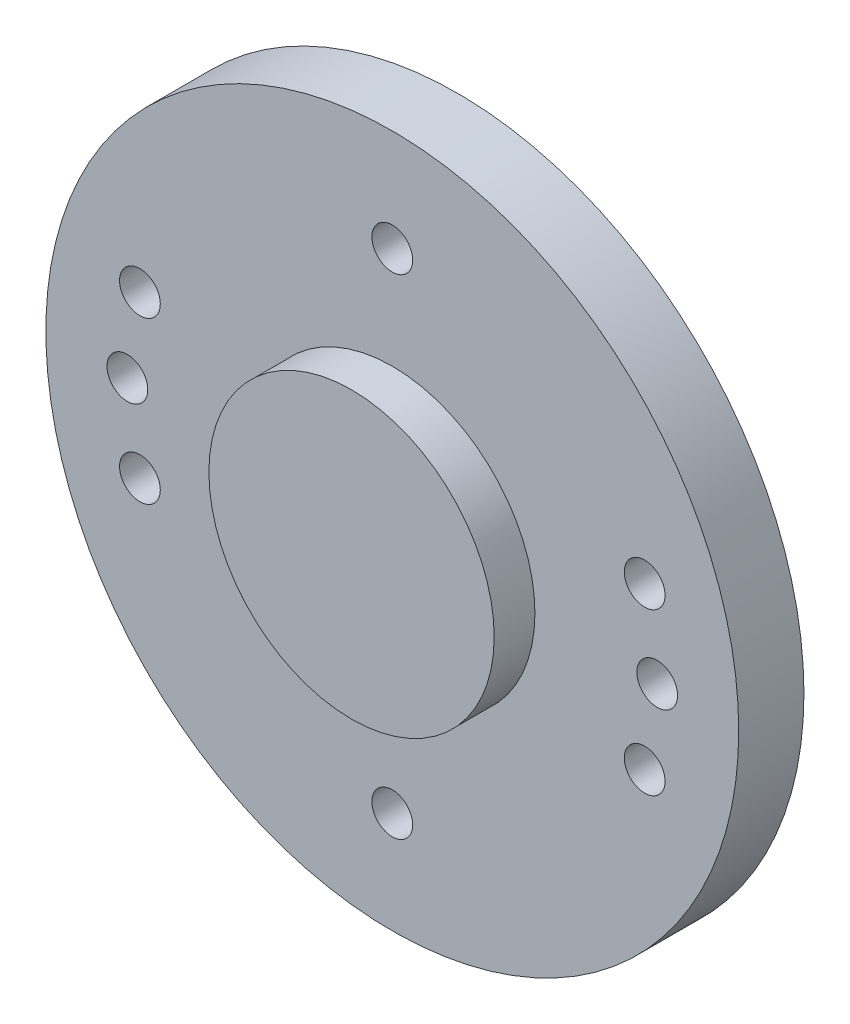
from build123d import *

# Parameters (mm, degrees)
ESQUISSE1_R             = 8.5
EXTRUSION1_DEPTH        = 1.6
ESQUISSE2_R             = 3.5
EXTRUSION2_DEPTH        = 1
ESQUISSE3_R             = 4
EXTRUSION3_DEPTH        = 2.5
ESQUISSE7_R             = 0.5
ENL_V_MAT_EXTRU_2_DEPTH = 13.700787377
ESQUISSE8_R             = 2.9
EXTRUSION4_DEPTH        = 2.7


with BuildPart() as part:
    # Esquisse1 → Extrusion1 (new body)
    with BuildSketch(Plane.XY):
        Circle(ESQUISSE1_R)
    extrude(amount=EXTRUSION1_DEPTH)

    # Esquisse2 → Extrusion2 (add)
    with BuildSketch(Plane.XY.offset(1.6)):
        Circle(ESQUISSE2_R)
    extrude(amount=EXTRUSION2_DEPTH)

    # Esquisse3 → Extrusion3 (add)
    with BuildSketch(Plane(origin=(0, 0, 0), x_dir=(-1, 0, 0), z_dir=(0, 0, -1))):
        with Locations(Location((0, 0, 0), (0, 0, 180))):
            Circle(ESQUISSE3_R)
    extrude(amount=EXTRUSION3_DEPTH)

    # Esquisse7 → Enl_v. mat.-Extru.2 (cut, through all)
    with BuildSketch(Plane.XY.offset(1.6)):
        with Locations((0, 6)):
            Circle(ESQUISSE7_R)
        with Locations((0, -6)):
            Circle(ESQUISSE7_R)
        with Locations((-6.192307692, -1.976189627)):
            Circle(ESQUISSE7_R)
        with Locations((-6.5, 0)):
            Circle(ESQUISSE7_R)
        with Locations((-6.192307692, 1.976189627)):
            Circle(ESQUISSE7_R)
        with Locations((6.192307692, -1.976189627)):
            Circle(ESQUISSE7_R)
        with Locations((6.5, 0)):
            Circle(ESQUISSE7_R)
        with Locations((6.192307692, 1.976189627)):
            Circle(ESQUISSE7_R)
    extrude(amount=-ENL_V_MAT_EXTRU_2_DEPTH, mode=Mode.SUBTRACT)

    # Esquisse8 → Extrusion4 (cut)
    with BuildSketch(Plane(origin=(0, 0, -2.5), x_dir=(-1, 0, 0), z_dir=(0, 0, -1))):
        Circle(ESQUISSE8_R)
    extrude(amount=-EXTRUSION4_DEPTH, mode=Mode.SUBTRACT)


solid = part.part
